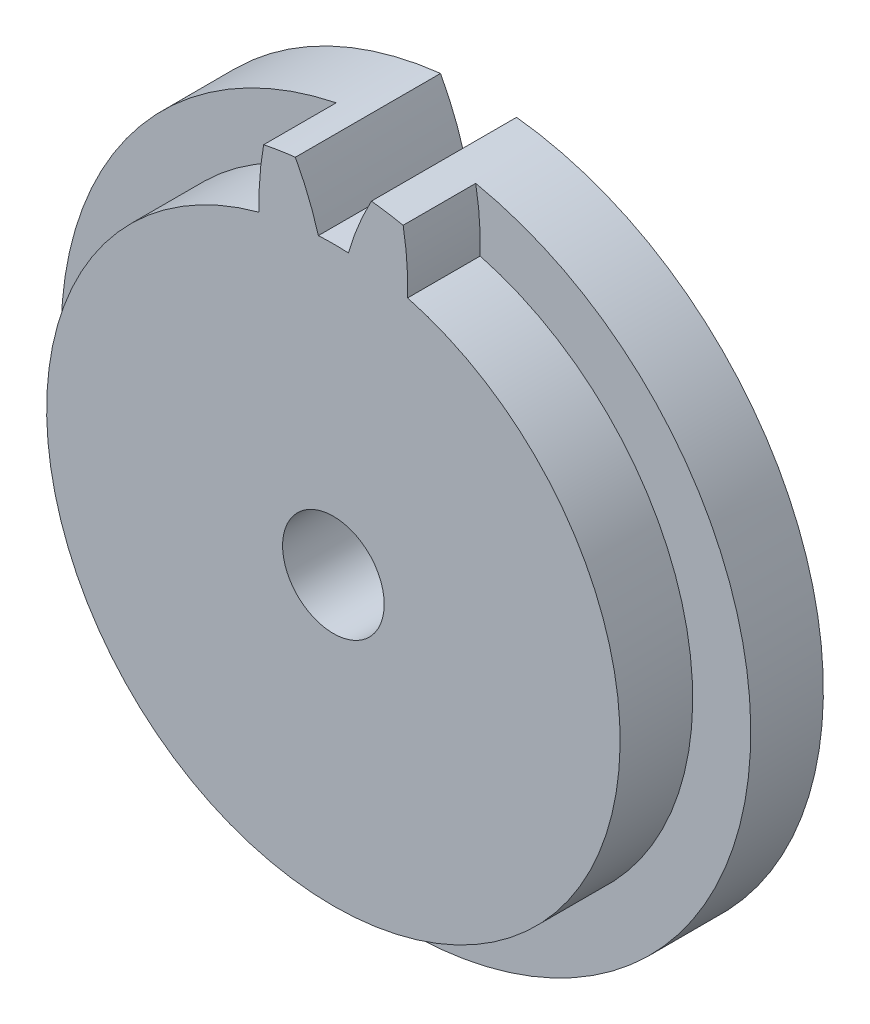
ISO-10303-21;
HEADER;
FILE_DESCRIPTION(('STEP AP214'),'2;1');
FILE_NAME('part.step','',(''),(''),'','','');
FILE_SCHEMA(('AUTOMOTIVE_DESIGN { 1 0 10303 214 1 1 1 1 }'));
ENDSEC;
DATA;
#1=APPLICATION_CONTEXT('core data for automotive mechanical design processes');
#2=APPLICATION_PROTOCOL_DEFINITION('international standard','automotive_design',2000,#1);
#3=PRODUCT_CONTEXT('',#1,'mechanical');
#4=PRODUCT('Part','Part','',(#3));
#5=PRODUCT_RELATED_PRODUCT_CATEGORY('part','',(#4));
#6=PRODUCT_DEFINITION_FORMATION('','',#4);
#7=PRODUCT_DEFINITION_CONTEXT('part definition',#1,'design');
#8=PRODUCT_DEFINITION('design','',#6,#7);
#9=PRODUCT_DEFINITION_SHAPE('','',#8);
#10=(LENGTH_UNIT() NAMED_UNIT(*) SI_UNIT(.MILLI.,.METRE.));
#11=(NAMED_UNIT(*) PLANE_ANGLE_UNIT() SI_UNIT($,.RADIAN.));
#12=(NAMED_UNIT(*) SI_UNIT($,.STERADIAN.) SOLID_ANGLE_UNIT());
#13=UNCERTAINTY_MEASURE_WITH_UNIT(LENGTH_MEASURE(1.E-05),#10,'distance_accuracy_value','');
#14=(GEOMETRIC_REPRESENTATION_CONTEXT(3) GLOBAL_UNCERTAINTY_ASSIGNED_CONTEXT((#13)) GLOBAL_UNIT_ASSIGNED_CONTEXT((#10,
#11,#12)) REPRESENTATION_CONTEXT('',''));
#15=CARTESIAN_POINT('',(0.,0.,0.));
#16=DIRECTION('',(0.,0.,1.));
#17=DIRECTION('',(1.,0.,0.));
#18=AXIS2_PLACEMENT_3D('',#15,#16,#17);
#19=CARTESIAN_POINT('',(0.,0.,10.));
#20=DIRECTION('',(0.,0.,1.));
#21=DIRECTION('',(1.,0.,0.));
#22=AXIS2_PLACEMENT_3D('',#19,#20,#21);
#23=PLANE('',#22);
#24=CARTESIAN_POINT('',(0.,-15.5,10.));
#25=DIRECTION('',(0.,0.,1.));
#26=DIRECTION('',(1.,0.,0.));
#27=AXIS2_PLACEMENT_3D('',#24,#25,#26);
#28=CIRCLE('',#27,7.);
#29=CARTESIAN_POINT('',(7.,-15.5,10.));
#30=VERTEX_POINT('',#29);
#31=EDGE_CURVE('E132',#30,#30,#28,.T.);
#32=ORIENTED_EDGE('',*,*,#31,.F.);
#33=EDGE_LOOP('',(#32));
#34=FACE_BOUND('',#33,.T.);
#35=CARTESIAN_POINT('',(-29.6304199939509,23.9300477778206,10.));
#36=DIRECTION('',(0.,0.,1.));
#37=DIRECTION('',(1.,0.,0.));
#38=AXIS2_PLACEMENT_3D('',#35,#36,#37);
#39=CIRCLE('',#38,39.8741932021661);
#40=CARTESIAN_POINT('',(9.60875159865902,31.017973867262,10.));
#41=VERTEX_POINT('',#40);
#42=CARTESIAN_POINT('',(10.2233522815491,22.6540701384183,10.));
#43=VERTEX_POINT('',#42);
#44=EDGE_CURVE('E138',#41,#43,#39,.F.);
#45=ORIENTED_EDGE('',*,*,#44,.F.);
#46=CARTESIAN_POINT('',(0.,-15.5,10.));
#47=DIRECTION('',(0.,0.,1.));
#48=DIRECTION('',(1.,0.,0.));
#49=AXIS2_PLACEMENT_3D('',#46,#47,#48);
#50=CIRCLE('',#49,47.5);
#51=CARTESIAN_POINT('',(5.23637864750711,31.7104897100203,10.));
#52=VERTEX_POINT('',#51);
#53=EDGE_CURVE('E174',#41,#52,#50,.T.);
#54=ORIENTED_EDGE('',*,*,#53,.T.);
#55=CARTESIAN_POINT('',(40.3647588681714,12.8439005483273,10.));
#56=DIRECTION('',(0.,0.,1.));
#57=DIRECTION('',(1.,0.,0.));
#58=AXIS2_PLACEMENT_3D('',#55,#56,#57);
#59=CIRCLE('',#58,39.8741932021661);
#60=CARTESIAN_POINT('',(2.06727027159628,23.9458666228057,10.));
#61=VERTEX_POINT('',#60);
#62=EDGE_CURVE('E117',#52,#61,#59,.T.);
#63=ORIENTED_EDGE('',*,*,#62,.T.);
#64=CARTESIAN_POINT('',(0.,-15.5,10.));
#65=DIRECTION('',(0.,0.,1.));
#66=DIRECTION('',(1.,0.,0.));
#67=AXIS2_PLACEMENT_3D('',#64,#65,#66);
#68=CIRCLE('',#67,39.5);
#69=CARTESIAN_POINT('',(-2.06727027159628,23.9458666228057,10.));
#70=VERTEX_POINT('',#69);
#71=EDGE_CURVE('E139',#61,#70,#68,.T.);
#72=ORIENTED_EDGE('',*,*,#71,.T.);
#73=CARTESIAN_POINT('',(-40.3647588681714,12.8439005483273,10.));
#74=DIRECTION('',(0.,0.,1.));
#75=DIRECTION('',(1.,0.,0.));
#76=AXIS2_PLACEMENT_3D('',#73,#74,#75);
#77=CIRCLE('',#76,39.8741932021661);
#78=CARTESIAN_POINT('',(-5.23637864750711,31.7104897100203,10.));
#79=VERTEX_POINT('',#78);
#80=EDGE_CURVE('E142',#79,#70,#77,.F.);
#81=ORIENTED_EDGE('',*,*,#80,.F.);
#82=CARTESIAN_POINT('',(-9.60875159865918,31.017973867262,10.));
#83=VERTEX_POINT('',#82);
#84=EDGE_CURVE('E178',#79,#83,#50,.T.);
#85=ORIENTED_EDGE('',*,*,#84,.T.);
#86=CARTESIAN_POINT('',(29.6304199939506,23.9300477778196,10.));
#87=DIRECTION('',(0.,0.,1.));
#88=DIRECTION('',(1.,0.,0.));
#89=AXIS2_PLACEMENT_3D('',#86,#87,#88);
#90=CIRCLE('',#89,39.8741932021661);
#91=CARTESIAN_POINT('',(-10.2233522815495,22.6540701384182,10.));
#92=VERTEX_POINT('',#91);
#93=EDGE_CURVE('E62',#83,#92,#90,.T.);
#94=ORIENTED_EDGE('',*,*,#93,.T.);
#95=EDGE_CURVE('E135',#92,#43,#68,.T.);
#96=ORIENTED_EDGE('',*,*,#95,.T.);
#97=EDGE_LOOP('',(#45,#54,#63,#72,#81,#85,#94,#96));
#98=FACE_BOUND('',#97,.T.);
#99=ADVANCED_FACE('F40',(#34,#98),#23,.T.);
#100=CARTESIAN_POINT('',(-29.6304199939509,23.9300477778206,10.));
#101=DIRECTION('',(0.,0.,-1.));
#102=DIRECTION('',(-1.,0.,0.));
#103=AXIS2_PLACEMENT_3D('',#100,#101,#102);
#104=CYLINDRICAL_SURFACE('',#103,39.8741932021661);
#105=CARTESIAN_POINT('',(-29.6304199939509,23.9300477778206,0.));
#106=DIRECTION('',(0.,0.,1.));
#107=DIRECTION('',(1.,0.,0.));
#108=AXIS2_PLACEMENT_3D('',#105,#106,#107);
#109=CIRCLE('',#108,39.8741932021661);
#110=CARTESIAN_POINT('',(9.60875159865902,31.017973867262,0.));
#111=VERTEX_POINT('',#110);
#112=CARTESIAN_POINT('',(10.2233522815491,22.6540701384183,0.));
#113=VERTEX_POINT('',#112);
#114=EDGE_CURVE('E131',#111,#113,#109,.F.);
#115=ORIENTED_EDGE('',*,*,#114,.F.);
#116=DIRECTION('',(0.,0.,1.));
#117=VECTOR('',#116,1.);
#118=CARTESIAN_POINT('',(9.60875159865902,31.017973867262,0.));
#119=LINE('',#118,#117);
#120=EDGE_CURVE('E176',#111,#41,#119,.T.);
#121=ORIENTED_EDGE('',*,*,#120,.T.);
#122=ORIENTED_EDGE('',*,*,#44,.T.);
#123=DIRECTION('',(0.,0.,-1.));
#124=VECTOR('',#123,1.);
#125=CARTESIAN_POINT('',(10.2233522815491,22.6540701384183,10.));
#126=LINE('',#125,#124);
#127=EDGE_CURVE('E48',#43,#113,#126,.T.);
#128=ORIENTED_EDGE('',*,*,#127,.T.);
#129=EDGE_LOOP('',(#115,#121,#122,#128));
#130=FACE_BOUND('',#129,.T.);
#131=ADVANCED_FACE('F160',(#130),#104,.T.);
#132=CARTESIAN_POINT('',(40.3647588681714,12.8439005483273,10.));
#133=DIRECTION('',(0.,0.,-1.));
#134=DIRECTION('',(-1.,0.,0.));
#135=AXIS2_PLACEMENT_3D('',#132,#133,#134);
#136=CYLINDRICAL_SURFACE('',#135,39.8741932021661);
#137=DIRECTION('',(0.,0.,1.));
#138=VECTOR('',#137,1.);
#139=CARTESIAN_POINT('',(5.23637864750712,31.7104897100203,0.));
#140=LINE('',#139,#138);
#141=CARTESIAN_POINT('',(5.23637864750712,31.7104897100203,-10.));
#142=VERTEX_POINT('',#141);
#143=EDGE_CURVE('E105',#142,#52,#140,.T.);
#144=ORIENTED_EDGE('',*,*,#143,.F.);
#145=CARTESIAN_POINT('',(40.3647588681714,12.8439005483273,-10.));
#146=DIRECTION('',(0.,0.,1.));
#147=DIRECTION('',(1.,0.,0.));
#148=AXIS2_PLACEMENT_3D('',#145,#146,#147);
#149=CIRCLE('',#148,39.8741932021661);
#150=CARTESIAN_POINT('',(2.06727027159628,23.9458666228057,-10.));
#151=VERTEX_POINT('',#150);
#152=EDGE_CURVE('E115',#142,#151,#149,.T.);
#153=ORIENTED_EDGE('',*,*,#152,.T.);
#154=DIRECTION('',(0.,0.,-1.));
#155=VECTOR('',#154,1.);
#156=CARTESIAN_POINT('',(2.06727027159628,23.9458666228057,10.));
#157=LINE('',#156,#155);
#158=EDGE_CURVE('E155',#61,#151,#157,.T.);
#159=ORIENTED_EDGE('',*,*,#158,.F.);
#160=ORIENTED_EDGE('',*,*,#62,.F.);
#161=EDGE_LOOP('',(#144,#153,#159,#160));
#162=FACE_BOUND('',#161,.T.);
#163=ADVANCED_FACE('F113',(#162),#136,.T.);
#164=CARTESIAN_POINT('',(-40.3647588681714,12.8439005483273,10.));
#165=DIRECTION('',(0.,0.,-1.));
#166=DIRECTION('',(-1.,0.,0.));
#167=AXIS2_PLACEMENT_3D('',#164,#165,#166);
#168=CYLINDRICAL_SURFACE('',#167,39.8741932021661);
#169=CARTESIAN_POINT('',(-40.3647588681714,12.8439005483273,-10.));
#170=DIRECTION('',(0.,0.,1.));
#171=DIRECTION('',(1.,0.,0.));
#172=AXIS2_PLACEMENT_3D('',#169,#170,#171);
#173=CIRCLE('',#172,39.8741932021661);
#174=CARTESIAN_POINT('',(-2.06727027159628,23.9458666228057,-10.));
#175=VERTEX_POINT('',#174);
#176=CARTESIAN_POINT('',(-5.23637864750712,31.7104897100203,-10.));
#177=VERTEX_POINT('',#176);
#178=EDGE_CURVE('E125',#175,#177,#173,.T.);
#179=ORIENTED_EDGE('',*,*,#178,.T.);
#180=DIRECTION('',(0.,0.,1.));
#181=VECTOR('',#180,1.);
#182=CARTESIAN_POINT('',(-5.23637864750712,31.7104897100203,0.));
#183=LINE('',#182,#181);
#184=EDGE_CURVE('E54',#177,#79,#183,.T.);
#185=ORIENTED_EDGE('',*,*,#184,.T.);
#186=ORIENTED_EDGE('',*,*,#80,.T.);
#187=DIRECTION('',(0.,0.,-1.));
#188=VECTOR('',#187,1.);
#189=CARTESIAN_POINT('',(-2.06727027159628,23.9458666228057,10.));
#190=LINE('',#189,#188);
#191=EDGE_CURVE('E153',#70,#175,#190,.T.);
#192=ORIENTED_EDGE('',*,*,#191,.T.);
#193=EDGE_LOOP('',(#179,#185,#186,#192));
#194=FACE_BOUND('',#193,.T.);
#195=ADVANCED_FACE('F184',(#194),#168,.T.);
#196=CARTESIAN_POINT('',(29.6304199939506,23.9300477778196,10.));
#197=DIRECTION('',(0.,0.,-1.));
#198=DIRECTION('',(-1.,0.,0.));
#199=AXIS2_PLACEMENT_3D('',#196,#197,#198);
#200=CYLINDRICAL_SURFACE('',#199,39.8741932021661);
#201=DIRECTION('',(0.,0.,1.));
#202=VECTOR('',#201,1.);
#203=CARTESIAN_POINT('',(-9.60875159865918,31.0179738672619,0.));
#204=LINE('',#203,#202);
#205=CARTESIAN_POINT('',(-9.60875159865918,31.0179738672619,0.));
#206=VERTEX_POINT('',#205);
#207=EDGE_CURVE('E173',#206,#83,#204,.T.);
#208=ORIENTED_EDGE('',*,*,#207,.F.);
#209=CARTESIAN_POINT('',(29.6304199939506,23.9300477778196,0.));
#210=DIRECTION('',(0.,0.,1.));
#211=DIRECTION('',(1.,0.,0.));
#212=AXIS2_PLACEMENT_3D('',#209,#210,#211);
#213=CIRCLE('',#212,39.8741932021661);
#214=CARTESIAN_POINT('',(-10.2233522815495,22.6540701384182,0.));
#215=VERTEX_POINT('',#214);
#216=EDGE_CURVE('E148',#206,#215,#213,.T.);
#217=ORIENTED_EDGE('',*,*,#216,.T.);
#218=DIRECTION('',(0.,0.,-1.));
#219=VECTOR('',#218,1.);
#220=CARTESIAN_POINT('',(-10.2233522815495,22.6540701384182,10.));
#221=LINE('',#220,#219);
#222=EDGE_CURVE('E145',#92,#215,#221,.T.);
#223=ORIENTED_EDGE('',*,*,#222,.F.);
#224=ORIENTED_EDGE('',*,*,#93,.F.);
#225=EDGE_LOOP('',(#208,#217,#223,#224));
#226=FACE_BOUND('',#225,.T.);
#227=ADVANCED_FACE('F208',(#226),#200,.T.);
#228=CARTESIAN_POINT('',(20.1823794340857,-1.32804972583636,0.));
#229=DIRECTION('',(0.,0.,1.));
#230=DIRECTION('',(1.,0.,0.));
#231=AXIS2_PLACEMENT_3D('',#228,#229,#230);
#232=PLANE('',#231);
#233=ORIENTED_EDGE('',*,*,#216,.F.);
#234=CARTESIAN_POINT('',(0.,-15.5,0.));
#235=DIRECTION('',(0.,0.,1.));
#236=DIRECTION('',(1.,0.,0.));
#237=AXIS2_PLACEMENT_3D('',#234,#235,#236);
#238=CIRCLE('',#237,47.5);
#239=EDGE_CURVE('E171',#206,#111,#238,.T.);
#240=ORIENTED_EDGE('',*,*,#239,.T.);
#241=ORIENTED_EDGE('',*,*,#114,.T.);
#242=CARTESIAN_POINT('',(0.,-15.5,0.));
#243=DIRECTION('',(0.,0.,1.));
#244=DIRECTION('',(1.,0.,0.));
#245=AXIS2_PLACEMENT_3D('',#242,#243,#244);
#246=CIRCLE('',#245,39.5);
#247=EDGE_CURVE('E136',#215,#113,#246,.T.);
#248=ORIENTED_EDGE('',*,*,#247,.F.);
#249=EDGE_LOOP('',(#233,#240,#241,#248));
#250=FACE_BOUND('',#249,.T.);
#251=ADVANCED_FACE('F169',(#250),#232,.T.);
#252=CARTESIAN_POINT('',(20.1823794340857,-1.32804972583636,-10.));
#253=DIRECTION('',(0.,0.,1.));
#254=DIRECTION('',(1.,0.,0.));
#255=AXIS2_PLACEMENT_3D('',#252,#253,#254);
#256=PLANE('',#255);
#257=CARTESIAN_POINT('',(0.,-15.5,-10.));
#258=DIRECTION('',(0.,0.,1.));
#259=DIRECTION('',(1.,0.,0.));
#260=AXIS2_PLACEMENT_3D('',#257,#258,#259);
#261=CIRCLE('',#260,7.);
#262=CARTESIAN_POINT('',(7.,-15.5,-10.));
#263=VERTEX_POINT('',#262);
#264=EDGE_CURVE('E118',#263,#263,#261,.T.);
#265=ORIENTED_EDGE('',*,*,#264,.T.);
#266=EDGE_LOOP('',(#265));
#267=FACE_BOUND('',#266,.T.);
#268=CARTESIAN_POINT('',(0.,-15.5,-10.));
#269=DIRECTION('',(0.,0.,1.));
#270=DIRECTION('',(1.,0.,0.));
#271=AXIS2_PLACEMENT_3D('',#268,#269,#270);
#272=CIRCLE('',#271,47.5);
#273=EDGE_CURVE('E11',#177,#142,#272,.T.);
#274=ORIENTED_EDGE('',*,*,#273,.F.);
#275=ORIENTED_EDGE('',*,*,#178,.F.);
#276=CARTESIAN_POINT('',(0.,-15.5,-10.));
#277=DIRECTION('',(0.,0.,1.));
#278=DIRECTION('',(1.,0.,0.));
#279=AXIS2_PLACEMENT_3D('',#276,#277,#278);
#280=CIRCLE('',#279,39.5);
#281=EDGE_CURVE('E123',#151,#175,#280,.T.);
#282=ORIENTED_EDGE('',*,*,#281,.F.);
#283=ORIENTED_EDGE('',*,*,#152,.F.);
#284=EDGE_LOOP('',(#274,#275,#282,#283));
#285=FACE_BOUND('',#284,.T.);
#286=ADVANCED_FACE('F121',(#267,#285),#256,.F.);
#287=CARTESIAN_POINT('',(0.,-15.5,10.));
#288=DIRECTION('',(0.,0.,-1.));
#289=DIRECTION('',(-1.,0.,0.));
#290=AXIS2_PLACEMENT_3D('',#287,#288,#289);
#291=CYLINDRICAL_SURFACE('',#290,39.5);
#292=ORIENTED_EDGE('',*,*,#158,.T.);
#293=ORIENTED_EDGE('',*,*,#281,.T.);
#294=ORIENTED_EDGE('',*,*,#191,.F.);
#295=ORIENTED_EDGE('',*,*,#71,.F.);
#296=EDGE_LOOP('',(#292,#293,#294,#295));
#297=FACE_BOUND('',#296,.T.);
#298=ADVANCED_FACE('F189',(#297),#291,.T.);
#299=ORIENTED_EDGE('',*,*,#247,.T.);
#300=ORIENTED_EDGE('',*,*,#127,.F.);
#301=ORIENTED_EDGE('',*,*,#95,.F.);
#302=ORIENTED_EDGE('',*,*,#222,.T.);
#303=EDGE_LOOP('',(#299,#300,#301,#302));
#304=FACE_BOUND('',#303,.T.);
#305=ADVANCED_FACE('F164',(#304),#291,.T.);
#306=CARTESIAN_POINT('',(0.,-15.5,10.));
#307=DIRECTION('',(0.,0.,-1.));
#308=DIRECTION('',(-1.,0.,0.));
#309=AXIS2_PLACEMENT_3D('',#306,#307,#308);
#310=CYLINDRICAL_SURFACE('',#309,7.);
#311=ORIENTED_EDGE('',*,*,#31,.T.);
#312=EDGE_LOOP('',(#311));
#313=FACE_BOUND('',#312,.T.);
#314=ORIENTED_EDGE('',*,*,#264,.F.);
#315=EDGE_LOOP('',(#314));
#316=FACE_BOUND('',#315,.T.);
#317=ADVANCED_FACE('F42',(#313,#316),#310,.F.);
#318=CARTESIAN_POINT('',(0.,-15.5,-10.));
#319=DIRECTION('',(0.,0.,1.));
#320=DIRECTION('',(1.,0.,0.));
#321=AXIS2_PLACEMENT_3D('',#318,#319,#320);
#322=CYLINDRICAL_SURFACE('',#321,47.5);
#323=ORIENTED_EDGE('',*,*,#143,.T.);
#324=ORIENTED_EDGE('',*,*,#53,.F.);
#325=ORIENTED_EDGE('',*,*,#120,.F.);
#326=ORIENTED_EDGE('',*,*,#239,.F.);
#327=ORIENTED_EDGE('',*,*,#207,.T.);
#328=ORIENTED_EDGE('',*,*,#84,.F.);
#329=ORIENTED_EDGE('',*,*,#184,.F.);
#330=ORIENTED_EDGE('',*,*,#273,.T.);
#331=EDGE_LOOP('',(#323,#324,#325,#326,#327,#328,#329,#330));
#332=FACE_BOUND('',#331,.T.);
#333=ADVANCED_FACE('F104',(#332),#322,.T.);
#334=CLOSED_SHELL('',(#99,#131,#163,#195,#227,#251,#286,#298,#305,#317,#333));
#335=MANIFOLD_SOLID_BREP('B2',#334);
#336=ADVANCED_BREP_SHAPE_REPRESENTATION('',(#18,#335),#14);
#337=SHAPE_DEFINITION_REPRESENTATION(#9,#336);
ENDSEC;
END-ISO-10303-21;
